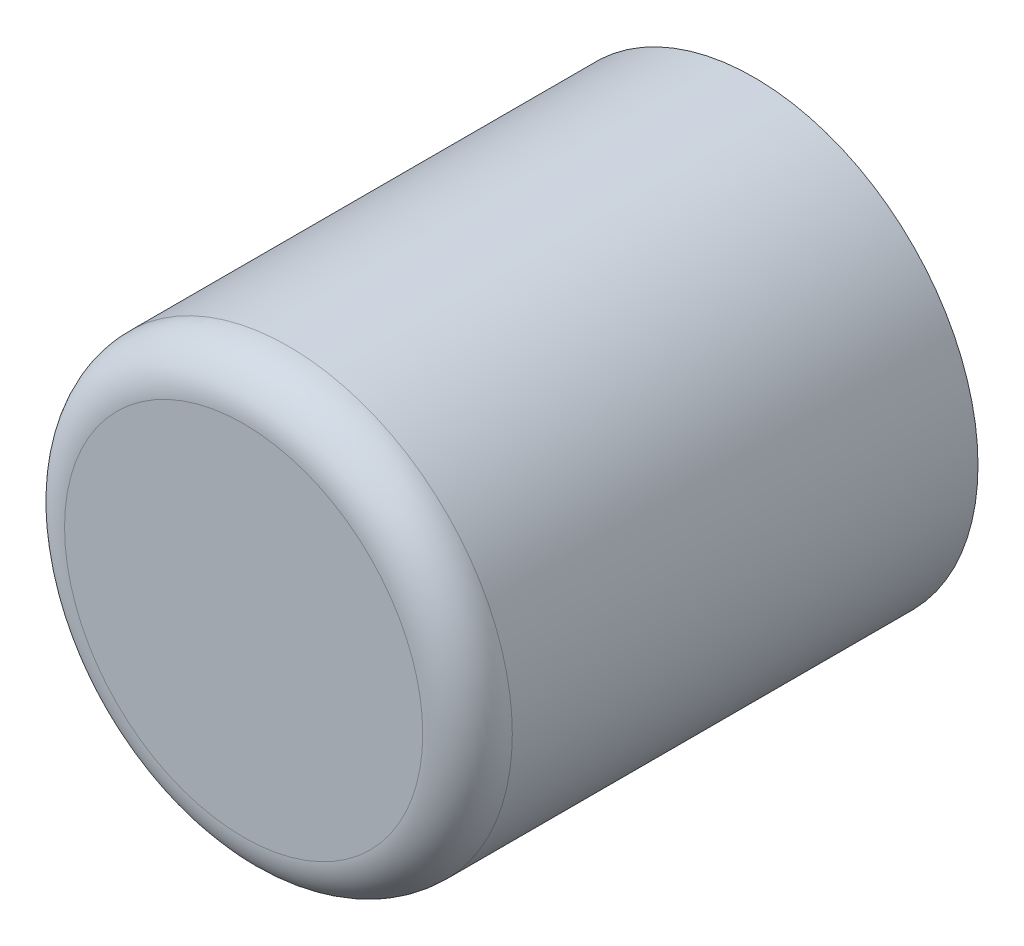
from build123d import *

# Parameters (mm, degrees)
SKETCH1_R          = 6.35
BASE_EXTRUDE_DEPTH = 14.478
FILLET1_R          = 1.27


with BuildPart() as part:
    # Sketch1 → Base-Extrude (new body)
    with BuildSketch(Plane.XY):
        Circle(SKETCH1_R)
    extrude(amount=BASE_EXTRUDE_DEPTH)

    # Fillet1
    fillet1_edges = [part.edges().sort_by_distance(p)[0] for p in [
        (-6.35, 0, 14.478),
    ]]
    fillet(fillet1_edges, radius=FILLET1_R)


solid = part.part
